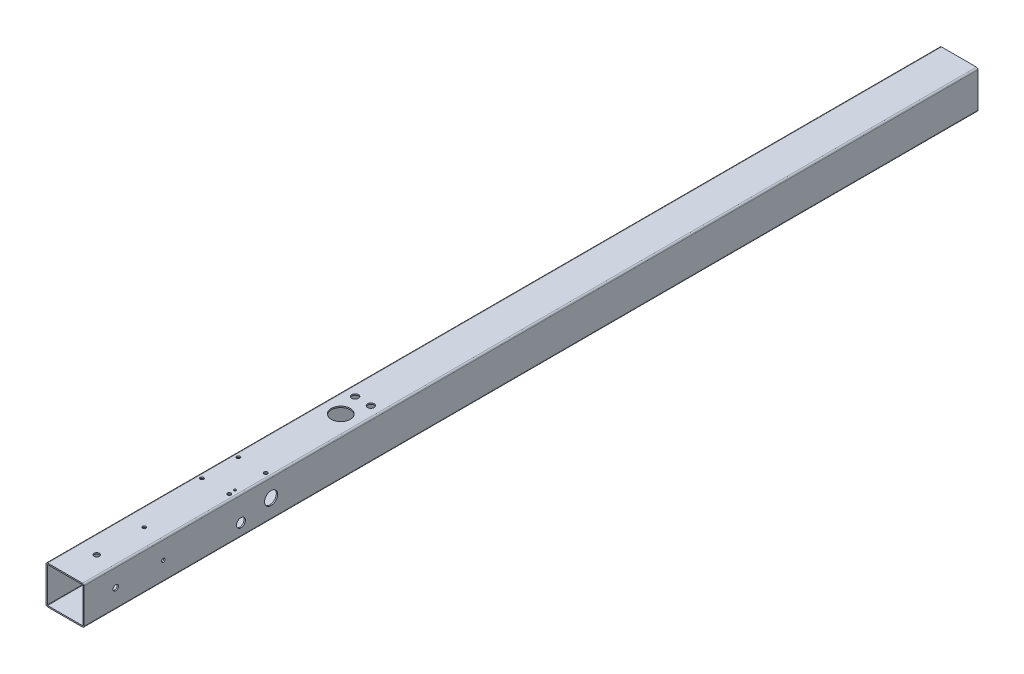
from build123d import *

# Parameters (mm, degrees)
BASE_EXTRUSION_DEPTH    = 2820
ESQUISSE2_R             = 8.5
ESQUISSE2_R_2           = 5.5
ESQUISSE2_R_3           = 30
ESQUISSE2_R_4           = 10.5
ENL_V_MAT_EXTRU_1_DEPTH = 10
ESQUISSE3_R             = 8.5
ESQUISSE3_R_2           = 5.5
ESQUISSE3_R_3           = 14
ESQUISSE3_R_4           = 20.5
ENL_V_MAT_EXTRU_2_DEPTH = 2826.101768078
ENL_V_START             = -10
ESQUISSE4_R             = 8.5
ESQUISSE4_R_2           = 5.5
ENL_V_MAT_EXTRU_3_DEPTH = 10
ESQUISSE5_R             = 3.5
ENL_V_MAT_EXTRU_4_DEPTH = 2826.101768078


with BuildPart() as part:
    # Esquisse1 → Base-Extrusion (new body)
    with BuildSketch(Plane.XY):
        with BuildLine():
            Line((5, 0), (115, 0))
            ThreePointArc((115, 0), (118.535533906, -1.464466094), (120, -5))
            Line((120, -5), (120, -115))
            ThreePointArc((120, -115), (118.535533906, -118.535533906), (115, -120))
            Line((115, -120), (5, -120))
            ThreePointArc((5, -120), (1.464466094, -118.535533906), (0, -115))
            Line((0, -115), (0, -5))
            ThreePointArc((0, -5), (1.464466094, -1.464466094), (5, 0))
        make_face()
        with BuildLine():
            Line((116, -5), (116, -115))
            ThreePointArc((116, -115), (115.707106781, -115.707106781), (115, -116))
            Line((115, -116), (5, -116))
            ThreePointArc((5, -116), (4.292893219, -115.707106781), (4, -115))
            Line((4, -115), (4, -5))
            ThreePointArc((4, -5), (4.292893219, -4.292893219), (5, -4))
            Line((5, -4), (115, -4))
            ThreePointArc((115, -4), (115.707106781, -4.292893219), (116, -5))
        make_face(mode=Mode.SUBTRACT)
    extrude(amount=BASE_EXTRUSION_DEPTH)

    # Esquisse2 → Enl_v. mat.-Extru.1 (cut)
    with BuildSketch(Plane(origin=(0, 0, 0), x_dir=(-1, 0, 0), z_dir=(0, 1, 0))):
        with Locations(Location((-60, 2720, 0), (0, 0, 90))):
            Circle(ESQUISSE2_R)
        with Locations(Location((-60, 2570, 0), (0, 0, 90))):
            Circle(ESQUISSE2_R_2)
        with Locations(Location((-60, 1950, 0), (0, 0, 90))):
            Circle(ESQUISSE2_R_3)
        with Locations(Location((-17, 2230, 0), (0, 0, 90))):
            Circle(ESQUISSE2_R_2)
        with Locations(Location((-17, 2345, 0), (0, 0, 90))):
            Circle(ESQUISSE2_R_2)
        with Locations(Location((-103, 2345, 0), (0, 0, 90))):
            Circle(ESQUISSE2_R_2)
        with Locations(Location((-103, 2230, 0), (0, 0, 90))):
            Circle(ESQUISSE2_R_2)
        with Locations(Location((-35, 1880, 0), (0, 0, 90))):
            Circle(ESQUISSE2_R_4)
        with Locations(Location((-85, 1880, 0), (0, 0, 90))):
            Circle(ESQUISSE2_R_4)
    extrude(amount=-ENL_V_MAT_EXTRU_1_DEPTH, mode=Mode.SUBTRACT)

    # Esquisse3 → Enl_v. mat.-Extru.2 (cut, through all)
    with BuildSketch(Plane.ZY):
        with Locations(Location((2720, -60, 0), (0, 0, 270))):
            Circle(ESQUISSE3_R)
        with Locations(Location((2570, -60, 0), (0, 0, 270))):
            Circle(ESQUISSE3_R_2)
        with Locations(Location((2325, -80, 0), (0, 0, 270))):
            Circle(ESQUISSE3_R_3)
        with Locations(Location((2230, -60, 0), (0, 0, 270))):
            Circle(ESQUISSE3_R_4)
    extrude(amount=-ENL_V_MAT_EXTRU_2_DEPTH, mode=Mode.SUBTRACT)

    # Esquisse4 → Enl_v. mat.-Extru.3 (cut)
    with BuildSketch(Plane.XZ.offset(120).offset(ENL_V_START)):
        with Locations(Location((60, 2720, 0), (0, 0, 90))):
            Circle(ESQUISSE4_R)
        with Locations(Location((60, 2570, 0), (0, 0, 90))):
            Circle(ESQUISSE4_R_2)
    extrude(amount=ENL_V_MAT_EXTRU_3_DEPTH, mode=Mode.SUBTRACT)

    # Esquisse5 → Enl_v. mat.-Extru.4 (cut, through all)
    with BuildSketch(Plane.XZ.offset(120)):
        with Locations(Location((101, 2325, 0), (0, 0, 270))):
            Circle(ESQUISSE5_R)
    extrude(amount=-ENL_V_MAT_EXTRU_4_DEPTH, mode=Mode.SUBTRACT)


solid = part.part
